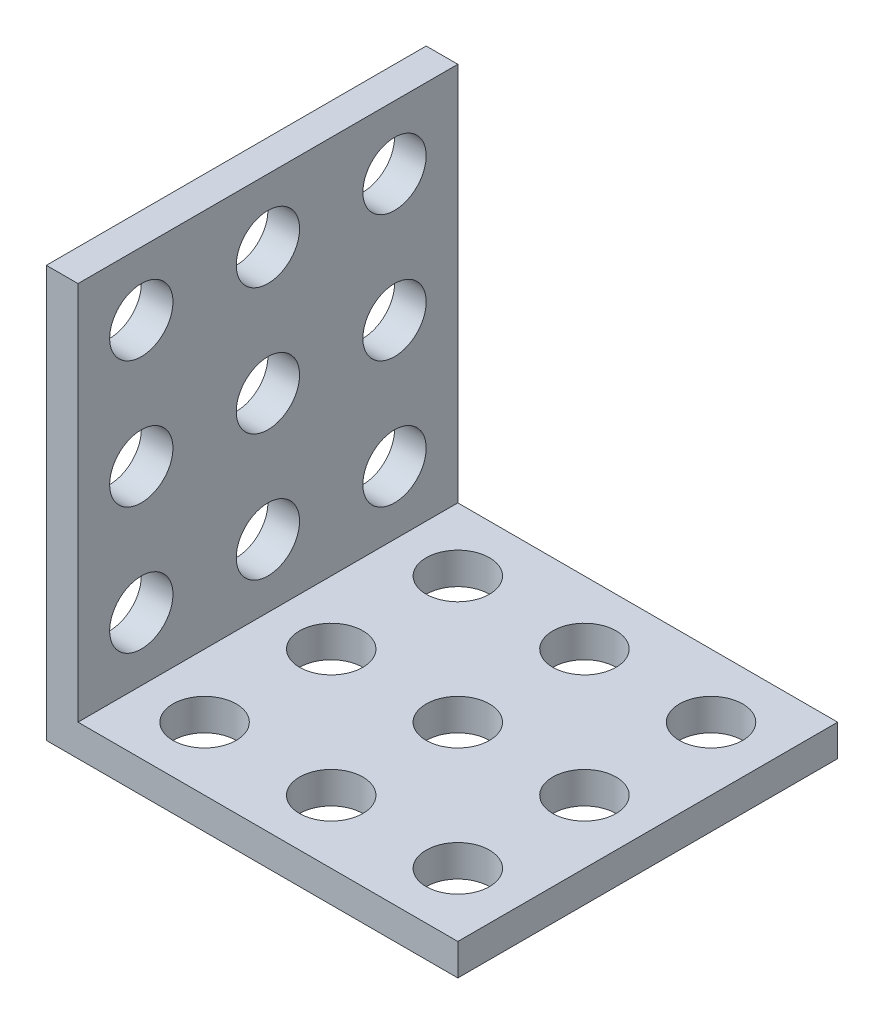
ISO-10303-21;
HEADER;
FILE_DESCRIPTION(('STEP AP214'),'2;1');
FILE_NAME('part.step','',(''),(''),'','','');
FILE_SCHEMA(('AUTOMOTIVE_DESIGN { 1 0 10303 214 1 1 1 1 }'));
ENDSEC;
DATA;
#1=APPLICATION_CONTEXT('core data for automotive mechanical design processes');
#2=APPLICATION_PROTOCOL_DEFINITION('international standard','automotive_design',2000,#1);
#3=PRODUCT_CONTEXT('',#1,'mechanical');
#4=PRODUCT('Part','Part','',(#3));
#5=PRODUCT_RELATED_PRODUCT_CATEGORY('part','',(#4));
#6=PRODUCT_DEFINITION_FORMATION('','',#4);
#7=PRODUCT_DEFINITION_CONTEXT('part definition',#1,'design');
#8=PRODUCT_DEFINITION('design','',#6,#7);
#9=PRODUCT_DEFINITION_SHAPE('','',#8);
#10=(LENGTH_UNIT() NAMED_UNIT(*) SI_UNIT(.MILLI.,.METRE.));
#11=(NAMED_UNIT(*) PLANE_ANGLE_UNIT() SI_UNIT($,.RADIAN.));
#12=(NAMED_UNIT(*) SI_UNIT($,.STERADIAN.) SOLID_ANGLE_UNIT());
#13=UNCERTAINTY_MEASURE_WITH_UNIT(LENGTH_MEASURE(1.E-05),#10,'distance_accuracy_value','');
#14=(GEOMETRIC_REPRESENTATION_CONTEXT(3) GLOBAL_UNCERTAINTY_ASSIGNED_CONTEXT((#13)) GLOBAL_UNIT_ASSIGNED_CONTEXT((#10,
#11,#12)) REPRESENTATION_CONTEXT('',''));
#15=CARTESIAN_POINT('',(0.,0.,0.));
#16=DIRECTION('',(0.,0.,1.));
#17=DIRECTION('',(1.,0.,0.));
#18=AXIS2_PLACEMENT_3D('',#15,#16,#17);
#19=CARTESIAN_POINT('',(26.,0.,24.));
#20=DIRECTION('',(0.,1.,0.));
#21=DIRECTION('',(-1.,0.,0.));
#22=AXIS2_PLACEMENT_3D('',#19,#20,#21);
#23=PLANE('',#22);
#24=CARTESIAN_POINT('',(5.99999999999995,0.,4.));
#25=DIRECTION('',(0.,1.,0.));
#26=DIRECTION('',(-1.,0.,0.));
#27=AXIS2_PLACEMENT_3D('',#24,#25,#26);
#28=CIRCLE('',#27,2.);
#29=CARTESIAN_POINT('',(3.99999999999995,0.,4.));
#30=VERTEX_POINT('',#29);
#31=EDGE_CURVE('E221',#30,#30,#28,.T.);
#32=ORIENTED_EDGE('',*,*,#31,.T.);
#33=EDGE_LOOP('',(#32));
#34=FACE_BOUND('',#33,.T.);
#35=CARTESIAN_POINT('',(5.99999999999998,0.,12.));
#36=DIRECTION('',(0.,1.,0.));
#37=DIRECTION('',(-1.,0.,0.));
#38=AXIS2_PLACEMENT_3D('',#35,#36,#37);
#39=CIRCLE('',#38,2.);
#40=CARTESIAN_POINT('',(3.99999999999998,0.,12.));
#41=VERTEX_POINT('',#40);
#42=EDGE_CURVE('E218',#41,#41,#39,.T.);
#43=ORIENTED_EDGE('',*,*,#42,.T.);
#44=EDGE_LOOP('',(#43));
#45=FACE_BOUND('',#44,.T.);
#46=CARTESIAN_POINT('',(21.9999999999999,0.,4.));
#47=DIRECTION('',(0.,1.,0.));
#48=DIRECTION('',(-1.,0.,0.));
#49=AXIS2_PLACEMENT_3D('',#46,#47,#48);
#50=CIRCLE('',#49,2.);
#51=CARTESIAN_POINT('',(19.9999999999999,0.,4.));
#52=VERTEX_POINT('',#51);
#53=EDGE_CURVE('E215',#52,#52,#50,.T.);
#54=ORIENTED_EDGE('',*,*,#53,.T.);
#55=EDGE_LOOP('',(#54));
#56=FACE_BOUND('',#55,.T.);
#57=CARTESIAN_POINT('',(13.9999999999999,0.,4.));
#58=DIRECTION('',(0.,1.,0.));
#59=DIRECTION('',(-1.,0.,0.));
#60=AXIS2_PLACEMENT_3D('',#57,#58,#59);
#61=CIRCLE('',#60,2.);
#62=CARTESIAN_POINT('',(11.9999999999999,0.,4.));
#63=VERTEX_POINT('',#62);
#64=EDGE_CURVE('E212',#63,#63,#61,.T.);
#65=ORIENTED_EDGE('',*,*,#64,.T.);
#66=EDGE_LOOP('',(#65));
#67=FACE_BOUND('',#66,.T.);
#68=CARTESIAN_POINT('',(22.,0.,12.));
#69=DIRECTION('',(0.,1.,0.));
#70=DIRECTION('',(-1.,0.,0.));
#71=AXIS2_PLACEMENT_3D('',#68,#69,#70);
#72=CIRCLE('',#71,2.);
#73=CARTESIAN_POINT('',(20.,0.,12.));
#74=VERTEX_POINT('',#73);
#75=EDGE_CURVE('E209',#74,#74,#72,.T.);
#76=ORIENTED_EDGE('',*,*,#75,.T.);
#77=EDGE_LOOP('',(#76));
#78=FACE_BOUND('',#77,.T.);
#79=CARTESIAN_POINT('',(14.,0.,12.));
#80=DIRECTION('',(0.,1.,0.));
#81=DIRECTION('',(-1.,0.,0.));
#82=AXIS2_PLACEMENT_3D('',#79,#80,#81);
#83=CIRCLE('',#82,2.);
#84=CARTESIAN_POINT('',(12.,0.,12.));
#85=VERTEX_POINT('',#84);
#86=EDGE_CURVE('E206',#85,#85,#83,.T.);
#87=ORIENTED_EDGE('',*,*,#86,.T.);
#88=EDGE_LOOP('',(#87));
#89=FACE_BOUND('',#88,.T.);
#90=CARTESIAN_POINT('',(22.,0.,20.));
#91=DIRECTION('',(0.,1.,0.));
#92=DIRECTION('',(-1.,0.,0.));
#93=AXIS2_PLACEMENT_3D('',#90,#91,#92);
#94=CIRCLE('',#93,2.);
#95=CARTESIAN_POINT('',(20.,0.,20.));
#96=VERTEX_POINT('',#95);
#97=EDGE_CURVE('E203',#96,#96,#94,.T.);
#98=ORIENTED_EDGE('',*,*,#97,.T.);
#99=EDGE_LOOP('',(#98));
#100=FACE_BOUND('',#99,.T.);
#101=CARTESIAN_POINT('',(14.,0.,20.));
#102=DIRECTION('',(0.,1.,0.));
#103=DIRECTION('',(-1.,0.,0.));
#104=AXIS2_PLACEMENT_3D('',#101,#102,#103);
#105=CIRCLE('',#104,2.);
#106=CARTESIAN_POINT('',(12.,0.,20.));
#107=VERTEX_POINT('',#106);
#108=EDGE_CURVE('E192',#107,#107,#105,.T.);
#109=ORIENTED_EDGE('',*,*,#108,.T.);
#110=EDGE_LOOP('',(#109));
#111=FACE_BOUND('',#110,.T.);
#112=CARTESIAN_POINT('',(6.,0.,20.));
#113=DIRECTION('',(0.,1.,0.));
#114=DIRECTION('',(-1.,0.,0.));
#115=AXIS2_PLACEMENT_3D('',#112,#113,#114);
#116=CIRCLE('',#115,2.);
#117=CARTESIAN_POINT('',(4.,0.,20.));
#118=VERTEX_POINT('',#117);
#119=EDGE_CURVE('E126',#118,#118,#116,.T.);
#120=ORIENTED_EDGE('',*,*,#119,.T.);
#121=EDGE_LOOP('',(#120));
#122=FACE_BOUND('',#121,.T.);
#123=DIRECTION('',(1.,0.,0.));
#124=VECTOR('',#123,1.);
#125=CARTESIAN_POINT('',(26.,0.,0.));
#126=LINE('',#125,#124);
#127=CARTESIAN_POINT('',(0.,0.,0.));
#128=VERTEX_POINT('',#127);
#129=CARTESIAN_POINT('',(26.,0.,0.));
#130=VERTEX_POINT('',#129);
#131=EDGE_CURVE('E122',#128,#130,#126,.T.);
#132=ORIENTED_EDGE('',*,*,#131,.T.);
#133=DIRECTION('',(0.,0.,-1.));
#134=VECTOR('',#133,1.);
#135=CARTESIAN_POINT('',(26.,0.,24.));
#136=LINE('',#135,#134);
#137=CARTESIAN_POINT('',(26.,0.,24.));
#138=VERTEX_POINT('',#137);
#139=EDGE_CURVE('E11',#138,#130,#136,.T.);
#140=ORIENTED_EDGE('',*,*,#139,.F.);
#141=DIRECTION('',(1.,0.,0.));
#142=VECTOR('',#141,1.);
#143=CARTESIAN_POINT('',(26.,0.,24.));
#144=LINE('',#143,#142);
#145=CARTESIAN_POINT('',(0.,0.,24.));
#146=VERTEX_POINT('',#145);
#147=EDGE_CURVE('E133',#146,#138,#144,.T.);
#148=ORIENTED_EDGE('',*,*,#147,.F.);
#149=DIRECTION('',(0.,0.,-1.));
#150=VECTOR('',#149,1.);
#151=CARTESIAN_POINT('',(0.,0.,24.));
#152=LINE('',#151,#150);
#153=EDGE_CURVE('E118',#146,#128,#152,.T.);
#154=ORIENTED_EDGE('',*,*,#153,.T.);
#155=EDGE_LOOP('',(#132,#140,#148,#154));
#156=FACE_BOUND('',#155,.T.);
#157=ADVANCED_FACE('F36',(#34,#45,#56,#67,#78,#89,#100,#111,#122,#156),#23,.F.);
#158=CARTESIAN_POINT('',(26.,2.,24.));
#159=DIRECTION('',(-1.,0.,0.));
#160=DIRECTION('',(0.,0.,1.));
#161=AXIS2_PLACEMENT_3D('',#158,#159,#160);
#162=PLANE('',#161);
#163=DIRECTION('',(0.,1.,0.));
#164=VECTOR('',#163,1.);
#165=CARTESIAN_POINT('',(26.,2.,0.));
#166=LINE('',#165,#164);
#167=CARTESIAN_POINT('',(26.,2.,0.));
#168=VERTEX_POINT('',#167);
#169=EDGE_CURVE('E125',#130,#168,#166,.T.);
#170=ORIENTED_EDGE('',*,*,#169,.T.);
#171=DIRECTION('',(0.,0.,-1.));
#172=VECTOR('',#171,1.);
#173=CARTESIAN_POINT('',(26.,2.,24.));
#174=LINE('',#173,#172);
#175=CARTESIAN_POINT('',(26.,2.,24.));
#176=VERTEX_POINT('',#175);
#177=EDGE_CURVE('E45',#176,#168,#174,.T.);
#178=ORIENTED_EDGE('',*,*,#177,.F.);
#179=DIRECTION('',(0.,1.,0.));
#180=VECTOR('',#179,1.);
#181=CARTESIAN_POINT('',(26.,2.,24.));
#182=LINE('',#181,#180);
#183=EDGE_CURVE('E91',#138,#176,#182,.T.);
#184=ORIENTED_EDGE('',*,*,#183,.F.);
#185=ORIENTED_EDGE('',*,*,#139,.T.);
#186=EDGE_LOOP('',(#170,#178,#184,#185));
#187=FACE_BOUND('',#186,.T.);
#188=ADVANCED_FACE('F232',(#187),#162,.F.);
#189=CARTESIAN_POINT('',(2.,2.,24.));
#190=DIRECTION('',(0.,-1.,0.));
#191=DIRECTION('',(1.,0.,0.));
#192=AXIS2_PLACEMENT_3D('',#189,#190,#191);
#193=PLANE('',#192);
#194=CARTESIAN_POINT('',(5.99999999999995,2.,4.));
#195=DIRECTION('',(0.,1.,0.));
#196=DIRECTION('',(-1.,0.,0.));
#197=AXIS2_PLACEMENT_3D('',#194,#195,#196);
#198=CIRCLE('',#197,2.);
#199=CARTESIAN_POINT('',(3.99999999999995,2.,4.));
#200=VERTEX_POINT('',#199);
#201=EDGE_CURVE('E142',#200,#200,#198,.T.);
#202=ORIENTED_EDGE('',*,*,#201,.F.);
#203=EDGE_LOOP('',(#202));
#204=FACE_BOUND('',#203,.T.);
#205=CARTESIAN_POINT('',(5.99999999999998,2.,12.));
#206=DIRECTION('',(0.,1.,0.));
#207=DIRECTION('',(-1.,0.,0.));
#208=AXIS2_PLACEMENT_3D('',#205,#206,#207);
#209=CIRCLE('',#208,2.);
#210=CARTESIAN_POINT('',(3.99999999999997,2.,12.));
#211=VERTEX_POINT('',#210);
#212=EDGE_CURVE('E184',#211,#211,#209,.T.);
#213=ORIENTED_EDGE('',*,*,#212,.F.);
#214=EDGE_LOOP('',(#213));
#215=FACE_BOUND('',#214,.T.);
#216=CARTESIAN_POINT('',(21.9999999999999,2.,4.));
#217=DIRECTION('',(0.,1.,0.));
#218=DIRECTION('',(-1.,0.,0.));
#219=AXIS2_PLACEMENT_3D('',#216,#217,#218);
#220=CIRCLE('',#219,2.);
#221=CARTESIAN_POINT('',(19.9999999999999,2.,4.));
#222=VERTEX_POINT('',#221);
#223=EDGE_CURVE('E181',#222,#222,#220,.T.);
#224=ORIENTED_EDGE('',*,*,#223,.F.);
#225=EDGE_LOOP('',(#224));
#226=FACE_BOUND('',#225,.T.);
#227=CARTESIAN_POINT('',(13.9999999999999,2.,4.));
#228=DIRECTION('',(0.,1.,0.));
#229=DIRECTION('',(-1.,0.,0.));
#230=AXIS2_PLACEMENT_3D('',#227,#228,#229);
#231=CIRCLE('',#230,2.);
#232=CARTESIAN_POINT('',(11.9999999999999,2.,4.));
#233=VERTEX_POINT('',#232);
#234=EDGE_CURVE('E177',#233,#233,#231,.T.);
#235=ORIENTED_EDGE('',*,*,#234,.F.);
#236=EDGE_LOOP('',(#235));
#237=FACE_BOUND('',#236,.T.);
#238=CARTESIAN_POINT('',(22.,2.,12.));
#239=DIRECTION('',(0.,1.,0.));
#240=DIRECTION('',(-1.,0.,0.));
#241=AXIS2_PLACEMENT_3D('',#238,#239,#240);
#242=CIRCLE('',#241,2.);
#243=CARTESIAN_POINT('',(20.,2.,12.));
#244=VERTEX_POINT('',#243);
#245=EDGE_CURVE('E180',#244,#244,#242,.T.);
#246=ORIENTED_EDGE('',*,*,#245,.F.);
#247=EDGE_LOOP('',(#246));
#248=FACE_BOUND('',#247,.T.);
#249=CARTESIAN_POINT('',(14.,2.,12.));
#250=DIRECTION('',(0.,1.,0.));
#251=DIRECTION('',(-1.,0.,0.));
#252=AXIS2_PLACEMENT_3D('',#249,#250,#251);
#253=CIRCLE('',#252,2.);
#254=CARTESIAN_POINT('',(12.,2.,12.));
#255=VERTEX_POINT('',#254);
#256=EDGE_CURVE('E196',#255,#255,#253,.T.);
#257=ORIENTED_EDGE('',*,*,#256,.F.);
#258=EDGE_LOOP('',(#257));
#259=FACE_BOUND('',#258,.T.);
#260=CARTESIAN_POINT('',(22.,2.,20.));
#261=DIRECTION('',(0.,1.,0.));
#262=DIRECTION('',(-1.,0.,0.));
#263=AXIS2_PLACEMENT_3D('',#260,#261,#262);
#264=CIRCLE('',#263,2.);
#265=CARTESIAN_POINT('',(20.,2.,20.));
#266=VERTEX_POINT('',#265);
#267=EDGE_CURVE('E193',#266,#266,#264,.T.);
#268=ORIENTED_EDGE('',*,*,#267,.F.);
#269=EDGE_LOOP('',(#268));
#270=FACE_BOUND('',#269,.T.);
#271=CARTESIAN_POINT('',(14.,2.,20.));
#272=DIRECTION('',(0.,1.,0.));
#273=DIRECTION('',(-1.,0.,0.));
#274=AXIS2_PLACEMENT_3D('',#271,#272,#273);
#275=CIRCLE('',#274,2.);
#276=CARTESIAN_POINT('',(12.,2.,20.));
#277=VERTEX_POINT('',#276);
#278=EDGE_CURVE('E189',#277,#277,#275,.T.);
#279=ORIENTED_EDGE('',*,*,#278,.F.);
#280=EDGE_LOOP('',(#279));
#281=FACE_BOUND('',#280,.T.);
#282=CARTESIAN_POINT('',(6.,2.,20.));
#283=DIRECTION('',(0.,1.,0.));
#284=DIRECTION('',(-1.,0.,0.));
#285=AXIS2_PLACEMENT_3D('',#282,#283,#284);
#286=CIRCLE('',#285,2.);
#287=CARTESIAN_POINT('',(4.,2.,20.));
#288=VERTEX_POINT('',#287);
#289=EDGE_CURVE('E224',#288,#288,#286,.T.);
#290=ORIENTED_EDGE('',*,*,#289,.F.);
#291=EDGE_LOOP('',(#290));
#292=FACE_BOUND('',#291,.T.);
#293=DIRECTION('',(-1.,0.,0.));
#294=VECTOR('',#293,1.);
#295=CARTESIAN_POINT('',(2.,2.,0.));
#296=LINE('',#295,#294);
#297=CARTESIAN_POINT('',(2.,2.,0.));
#298=VERTEX_POINT('',#297);
#299=EDGE_CURVE('E128',#168,#298,#296,.T.);
#300=ORIENTED_EDGE('',*,*,#299,.T.);
#301=DIRECTION('',(0.,0.,-1.));
#302=VECTOR('',#301,1.);
#303=CARTESIAN_POINT('',(2.,2.,24.));
#304=LINE('',#303,#302);
#305=CARTESIAN_POINT('',(2.,2.,24.));
#306=VERTEX_POINT('',#305);
#307=EDGE_CURVE('E113',#306,#298,#304,.T.);
#308=ORIENTED_EDGE('',*,*,#307,.F.);
#309=DIRECTION('',(-1.,0.,0.));
#310=VECTOR('',#309,1.);
#311=CARTESIAN_POINT('',(2.,2.,24.));
#312=LINE('',#311,#310);
#313=EDGE_CURVE('E104',#176,#306,#312,.T.);
#314=ORIENTED_EDGE('',*,*,#313,.F.);
#315=ORIENTED_EDGE('',*,*,#177,.T.);
#316=EDGE_LOOP('',(#300,#308,#314,#315));
#317=FACE_BOUND('',#316,.T.);
#318=ADVANCED_FACE('F235',(#204,#215,#226,#237,#248,#259,#270,#281,#292,#317),#193,.F.);
#319=CARTESIAN_POINT('',(2.,26.,24.));
#320=DIRECTION('',(-1.,0.,0.));
#321=DIRECTION('',(0.,-1.,0.));
#322=AXIS2_PLACEMENT_3D('',#319,#320,#321);
#323=PLANE('',#322);
#324=CARTESIAN_POINT('',(2.,22.,20.));
#325=DIRECTION('',(1.,0.,0.));
#326=DIRECTION('',(0.,1.,0.));
#327=AXIS2_PLACEMENT_3D('',#324,#325,#326);
#328=CIRCLE('',#327,2.);
#329=CARTESIAN_POINT('',(2.,24.,20.));
#330=VERTEX_POINT('',#329);
#331=EDGE_CURVE('E385',#330,#330,#328,.T.);
#332=ORIENTED_EDGE('',*,*,#331,.F.);
#333=EDGE_LOOP('',(#332));
#334=FACE_BOUND('',#333,.T.);
#335=CARTESIAN_POINT('',(2.,14.,20.));
#336=DIRECTION('',(1.,0.,0.));
#337=DIRECTION('',(0.,1.,0.));
#338=AXIS2_PLACEMENT_3D('',#335,#336,#337);
#339=CIRCLE('',#338,2.);
#340=CARTESIAN_POINT('',(2.,16.,20.));
#341=VERTEX_POINT('',#340);
#342=EDGE_CURVE('E380',#341,#341,#339,.T.);
#343=ORIENTED_EDGE('',*,*,#342,.F.);
#344=EDGE_LOOP('',(#343));
#345=FACE_BOUND('',#344,.T.);
#346=CARTESIAN_POINT('',(2.,22.,4.));
#347=DIRECTION('',(1.,0.,0.));
#348=DIRECTION('',(0.,1.,0.));
#349=AXIS2_PLACEMENT_3D('',#346,#347,#348);
#350=CIRCLE('',#349,2.);
#351=CARTESIAN_POINT('',(2.,24.,4.));
#352=VERTEX_POINT('',#351);
#353=EDGE_CURVE('E375',#352,#352,#350,.T.);
#354=ORIENTED_EDGE('',*,*,#353,.F.);
#355=EDGE_LOOP('',(#354));
#356=FACE_BOUND('',#355,.T.);
#357=CARTESIAN_POINT('',(2.,22.,12.));
#358=DIRECTION('',(1.,0.,0.));
#359=DIRECTION('',(0.,1.,0.));
#360=AXIS2_PLACEMENT_3D('',#357,#358,#359);
#361=CIRCLE('',#360,2.);
#362=CARTESIAN_POINT('',(2.,24.,12.));
#363=VERTEX_POINT('',#362);
#364=EDGE_CURVE('E356',#363,#363,#361,.T.);
#365=ORIENTED_EDGE('',*,*,#364,.F.);
#366=EDGE_LOOP('',(#365));
#367=FACE_BOUND('',#366,.T.);
#368=CARTESIAN_POINT('',(2.,14.,4.));
#369=DIRECTION('',(1.,0.,0.));
#370=DIRECTION('',(0.,1.,0.));
#371=AXIS2_PLACEMENT_3D('',#368,#369,#370);
#372=CIRCLE('',#371,2.);
#373=CARTESIAN_POINT('',(2.,16.,4.));
#374=VERTEX_POINT('',#373);
#375=EDGE_CURVE('E175',#374,#374,#372,.T.);
#376=ORIENTED_EDGE('',*,*,#375,.F.);
#377=EDGE_LOOP('',(#376));
#378=FACE_BOUND('',#377,.T.);
#379=CARTESIAN_POINT('',(2.,14.,12.));
#380=DIRECTION('',(1.,0.,0.));
#381=DIRECTION('',(0.,1.,0.));
#382=AXIS2_PLACEMENT_3D('',#379,#380,#381);
#383=CIRCLE('',#382,2.);
#384=CARTESIAN_POINT('',(2.,16.,12.));
#385=VERTEX_POINT('',#384);
#386=EDGE_CURVE('E378',#385,#385,#383,.T.);
#387=ORIENTED_EDGE('',*,*,#386,.F.);
#388=EDGE_LOOP('',(#387));
#389=FACE_BOUND('',#388,.T.);
#390=CARTESIAN_POINT('',(2.,6.,4.));
#391=DIRECTION('',(1.,0.,0.));
#392=DIRECTION('',(0.,1.,0.));
#393=AXIS2_PLACEMENT_3D('',#390,#391,#392);
#394=CIRCLE('',#393,2.);
#395=CARTESIAN_POINT('',(2.,8.,4.));
#396=VERTEX_POINT('',#395);
#397=EDGE_CURVE('E390',#396,#396,#394,.T.);
#398=ORIENTED_EDGE('',*,*,#397,.F.);
#399=EDGE_LOOP('',(#398));
#400=FACE_BOUND('',#399,.T.);
#401=CARTESIAN_POINT('',(2.,6.,12.));
#402=DIRECTION('',(1.,0.,0.));
#403=DIRECTION('',(0.,1.,0.));
#404=AXIS2_PLACEMENT_3D('',#401,#402,#403);
#405=CIRCLE('',#404,2.);
#406=CARTESIAN_POINT('',(2.,8.,12.));
#407=VERTEX_POINT('',#406);
#408=EDGE_CURVE('E148',#407,#407,#405,.T.);
#409=ORIENTED_EDGE('',*,*,#408,.F.);
#410=EDGE_LOOP('',(#409));
#411=FACE_BOUND('',#410,.T.);
#412=CARTESIAN_POINT('',(2.,6.,20.));
#413=DIRECTION('',(1.,0.,0.));
#414=DIRECTION('',(0.,1.,0.));
#415=AXIS2_PLACEMENT_3D('',#412,#413,#414);
#416=CIRCLE('',#415,2.);
#417=CARTESIAN_POINT('',(2.,8.,20.));
#418=VERTEX_POINT('',#417);
#419=EDGE_CURVE('E143',#418,#418,#416,.T.);
#420=ORIENTED_EDGE('',*,*,#419,.F.);
#421=EDGE_LOOP('',(#420));
#422=FACE_BOUND('',#421,.T.);
#423=DIRECTION('',(0.,1.,0.));
#424=VECTOR('',#423,1.);
#425=CARTESIAN_POINT('',(2.,26.,0.));
#426=LINE('',#425,#424);
#427=CARTESIAN_POINT('',(2.,26.,0.));
#428=VERTEX_POINT('',#427);
#429=EDGE_CURVE('E112',#298,#428,#426,.T.);
#430=ORIENTED_EDGE('',*,*,#429,.T.);
#431=DIRECTION('',(0.,0.,-1.));
#432=VECTOR('',#431,1.);
#433=CARTESIAN_POINT('',(2.,26.,24.));
#434=LINE('',#433,#432);
#435=CARTESIAN_POINT('',(2.,26.,24.));
#436=VERTEX_POINT('',#435);
#437=EDGE_CURVE('E109',#436,#428,#434,.T.);
#438=ORIENTED_EDGE('',*,*,#437,.F.);
#439=DIRECTION('',(0.,1.,0.));
#440=VECTOR('',#439,1.);
#441=CARTESIAN_POINT('',(2.,26.,24.));
#442=LINE('',#441,#440);
#443=EDGE_CURVE('E98',#306,#436,#442,.T.);
#444=ORIENTED_EDGE('',*,*,#443,.F.);
#445=ORIENTED_EDGE('',*,*,#307,.T.);
#446=EDGE_LOOP('',(#430,#438,#444,#445));
#447=FACE_BOUND('',#446,.T.);
#448=ADVANCED_FACE('F110',(#334,#345,#356,#367,#378,#389,#400,#411,#422,#447),#323,.F.);
#449=CARTESIAN_POINT('',(0.,26.,24.));
#450=DIRECTION('',(0.,-1.,0.));
#451=DIRECTION('',(0.,0.,-1.));
#452=AXIS2_PLACEMENT_3D('',#449,#450,#451);
#453=PLANE('',#452);
#454=DIRECTION('',(-1.,0.,0.));
#455=VECTOR('',#454,1.);
#456=CARTESIAN_POINT('',(0.,26.,0.));
#457=LINE('',#456,#455);
#458=CARTESIAN_POINT('',(0.,26.,0.));
#459=VERTEX_POINT('',#458);
#460=EDGE_CURVE('E77',#428,#459,#457,.T.);
#461=ORIENTED_EDGE('',*,*,#460,.T.);
#462=DIRECTION('',(0.,0.,-1.));
#463=VECTOR('',#462,1.);
#464=CARTESIAN_POINT('',(0.,26.,24.));
#465=LINE('',#464,#463);
#466=CARTESIAN_POINT('',(0.,26.,24.));
#467=VERTEX_POINT('',#466);
#468=EDGE_CURVE('E114',#467,#459,#465,.T.);
#469=ORIENTED_EDGE('',*,*,#468,.F.);
#470=DIRECTION('',(-1.,0.,0.));
#471=VECTOR('',#470,1.);
#472=CARTESIAN_POINT('',(0.,26.,24.));
#473=LINE('',#472,#471);
#474=EDGE_CURVE('E102',#436,#467,#473,.T.);
#475=ORIENTED_EDGE('',*,*,#474,.F.);
#476=ORIENTED_EDGE('',*,*,#437,.T.);
#477=EDGE_LOOP('',(#461,#469,#475,#476));
#478=FACE_BOUND('',#477,.T.);
#479=ADVANCED_FACE('F116',(#478),#453,.F.);
#480=CARTESIAN_POINT('',(0.,0.,24.));
#481=DIRECTION('',(1.,0.,0.));
#482=DIRECTION('',(0.,0.,-1.));
#483=AXIS2_PLACEMENT_3D('',#480,#481,#482);
#484=PLANE('',#483);
#485=CARTESIAN_POINT('',(0.,22.,20.));
#486=DIRECTION('',(1.,0.,0.));
#487=DIRECTION('',(0.,0.,-1.));
#488=AXIS2_PLACEMENT_3D('',#485,#486,#487);
#489=CIRCLE('',#488,2.);
#490=CARTESIAN_POINT('',(0.,22.,18.));
#491=VERTEX_POINT('',#490);
#492=EDGE_CURVE('E39',#491,#491,#489,.T.);
#493=ORIENTED_EDGE('',*,*,#492,.T.);
#494=EDGE_LOOP('',(#493));
#495=FACE_BOUND('',#494,.T.);
#496=CARTESIAN_POINT('',(0.,14.,20.));
#497=DIRECTION('',(1.,0.,0.));
#498=DIRECTION('',(0.,0.,-1.));
#499=AXIS2_PLACEMENT_3D('',#496,#497,#498);
#500=CIRCLE('',#499,2.);
#501=CARTESIAN_POINT('',(0.,14.,18.));
#502=VERTEX_POINT('',#501);
#503=EDGE_CURVE('E162',#502,#502,#500,.T.);
#504=ORIENTED_EDGE('',*,*,#503,.T.);
#505=EDGE_LOOP('',(#504));
#506=FACE_BOUND('',#505,.T.);
#507=CARTESIAN_POINT('',(0.,22.,4.));
#508=DIRECTION('',(1.,0.,0.));
#509=DIRECTION('',(0.,0.,-1.));
#510=AXIS2_PLACEMENT_3D('',#507,#508,#509);
#511=CIRCLE('',#510,2.);
#512=CARTESIAN_POINT('',(0.,22.,2.));
#513=VERTEX_POINT('',#512);
#514=EDGE_CURVE('E160',#513,#513,#511,.T.);
#515=ORIENTED_EDGE('',*,*,#514,.T.);
#516=EDGE_LOOP('',(#515));
#517=FACE_BOUND('',#516,.T.);
#518=CARTESIAN_POINT('',(0.,22.,12.));
#519=DIRECTION('',(1.,0.,0.));
#520=DIRECTION('',(0.,0.,-1.));
#521=AXIS2_PLACEMENT_3D('',#518,#519,#520);
#522=CIRCLE('',#521,2.);
#523=CARTESIAN_POINT('',(0.,22.,10.));
#524=VERTEX_POINT('',#523);
#525=EDGE_CURVE('E157',#524,#524,#522,.T.);
#526=ORIENTED_EDGE('',*,*,#525,.T.);
#527=EDGE_LOOP('',(#526));
#528=FACE_BOUND('',#527,.T.);
#529=CARTESIAN_POINT('',(0.,14.,4.));
#530=DIRECTION('',(1.,0.,0.));
#531=DIRECTION('',(0.,0.,-1.));
#532=AXIS2_PLACEMENT_3D('',#529,#530,#531);
#533=CIRCLE('',#532,2.);
#534=CARTESIAN_POINT('',(0.,14.,2.));
#535=VERTEX_POINT('',#534);
#536=EDGE_CURVE('E154',#535,#535,#533,.T.);
#537=ORIENTED_EDGE('',*,*,#536,.T.);
#538=EDGE_LOOP('',(#537));
#539=FACE_BOUND('',#538,.T.);
#540=CARTESIAN_POINT('',(0.,14.,12.));
#541=DIRECTION('',(1.,0.,0.));
#542=DIRECTION('',(0.,0.,-1.));
#543=AXIS2_PLACEMENT_3D('',#540,#541,#542);
#544=CIRCLE('',#543,2.);
#545=CARTESIAN_POINT('',(0.,14.,10.));
#546=VERTEX_POINT('',#545);
#547=EDGE_CURVE('E151',#546,#546,#544,.T.);
#548=ORIENTED_EDGE('',*,*,#547,.T.);
#549=EDGE_LOOP('',(#548));
#550=FACE_BOUND('',#549,.T.);
#551=CARTESIAN_POINT('',(0.,6.,4.));
#552=DIRECTION('',(1.,0.,0.));
#553=DIRECTION('',(0.,0.,-1.));
#554=AXIS2_PLACEMENT_3D('',#551,#552,#553);
#555=CIRCLE('',#554,2.);
#556=CARTESIAN_POINT('',(0.,6.,2.));
#557=VERTEX_POINT('',#556);
#558=EDGE_CURVE('E147',#557,#557,#555,.T.);
#559=ORIENTED_EDGE('',*,*,#558,.T.);
#560=EDGE_LOOP('',(#559));
#561=FACE_BOUND('',#560,.T.);
#562=CARTESIAN_POINT('',(0.,6.,12.));
#563=DIRECTION('',(1.,0.,0.));
#564=DIRECTION('',(0.,0.,-1.));
#565=AXIS2_PLACEMENT_3D('',#562,#563,#564);
#566=CIRCLE('',#565,2.);
#567=CARTESIAN_POINT('',(0.,6.,10.));
#568=VERTEX_POINT('',#567);
#569=EDGE_CURVE('E144',#568,#568,#566,.T.);
#570=ORIENTED_EDGE('',*,*,#569,.T.);
#571=EDGE_LOOP('',(#570));
#572=FACE_BOUND('',#571,.T.);
#573=CARTESIAN_POINT('',(0.,6.,20.));
#574=DIRECTION('',(1.,0.,0.));
#575=DIRECTION('',(0.,0.,-1.));
#576=AXIS2_PLACEMENT_3D('',#573,#574,#575);
#577=CIRCLE('',#576,2.);
#578=CARTESIAN_POINT('',(0.,6.,18.));
#579=VERTEX_POINT('',#578);
#580=EDGE_CURVE('E139',#579,#579,#577,.T.);
#581=ORIENTED_EDGE('',*,*,#580,.T.);
#582=EDGE_LOOP('',(#581));
#583=FACE_BOUND('',#582,.T.);
#584=DIRECTION('',(0.,-1.,0.));
#585=VECTOR('',#584,1.);
#586=CARTESIAN_POINT('',(0.,0.,0.));
#587=LINE('',#586,#585);
#588=EDGE_CURVE('E83',#459,#128,#587,.T.);
#589=ORIENTED_EDGE('',*,*,#588,.T.);
#590=ORIENTED_EDGE('',*,*,#153,.F.);
#591=DIRECTION('',(0.,-1.,0.));
#592=VECTOR('',#591,1.);
#593=CARTESIAN_POINT('',(0.,0.,24.));
#594=LINE('',#593,#592);
#595=EDGE_CURVE('E54',#467,#146,#594,.T.);
#596=ORIENTED_EDGE('',*,*,#595,.F.);
#597=ORIENTED_EDGE('',*,*,#468,.T.);
#598=EDGE_LOOP('',(#589,#590,#596,#597));
#599=FACE_BOUND('',#598,.T.);
#600=ADVANCED_FACE('F240',(#495,#506,#517,#528,#539,#550,#561,#572,#583,#599),#484,.F.);
#601=CARTESIAN_POINT('',(0.,0.,24.));
#602=DIRECTION('',(0.,0.,-1.));
#603=DIRECTION('',(-1.,0.,0.));
#604=AXIS2_PLACEMENT_3D('',#601,#602,#603);
#605=PLANE('',#604);
#606=ORIENTED_EDGE('',*,*,#147,.T.);
#607=ORIENTED_EDGE('',*,*,#183,.T.);
#608=ORIENTED_EDGE('',*,*,#313,.T.);
#609=ORIENTED_EDGE('',*,*,#443,.T.);
#610=ORIENTED_EDGE('',*,*,#474,.T.);
#611=ORIENTED_EDGE('',*,*,#595,.T.);
#612=EDGE_LOOP('',(#606,#607,#608,#609,#610,#611));
#613=FACE_BOUND('',#612,.T.);
#614=ADVANCED_FACE('F100',(#613),#605,.F.);
#615=CARTESIAN_POINT('',(0.,0.,0.));
#616=DIRECTION('',(0.,0.,-1.));
#617=DIRECTION('',(-1.,0.,0.));
#618=AXIS2_PLACEMENT_3D('',#615,#616,#617);
#619=PLANE('',#618);
#620=ORIENTED_EDGE('',*,*,#131,.F.);
#621=ORIENTED_EDGE('',*,*,#588,.F.);
#622=ORIENTED_EDGE('',*,*,#460,.F.);
#623=ORIENTED_EDGE('',*,*,#429,.F.);
#624=ORIENTED_EDGE('',*,*,#299,.F.);
#625=ORIENTED_EDGE('',*,*,#169,.F.);
#626=EDGE_LOOP('',(#620,#621,#622,#623,#624,#625));
#627=FACE_BOUND('',#626,.T.);
#628=ADVANCED_FACE('F238',(#627),#619,.T.);
#629=CARTESIAN_POINT('',(6.00000000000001,-22.,20.));
#630=DIRECTION('',(0.,1.,0.));
#631=DIRECTION('',(-1.,0.,0.));
#632=AXIS2_PLACEMENT_3D('',#629,#630,#631);
#633=CYLINDRICAL_SURFACE('',#632,2.);
#634=ORIENTED_EDGE('',*,*,#289,.T.);
#635=EDGE_LOOP('',(#634));
#636=FACE_BOUND('',#635,.T.);
#637=ORIENTED_EDGE('',*,*,#119,.F.);
#638=EDGE_LOOP('',(#637));
#639=FACE_BOUND('',#638,.T.);
#640=ADVANCED_FACE('F277',(#636,#639),#633,.F.);
#641=CARTESIAN_POINT('',(14.,-22.,20.));
#642=DIRECTION('',(0.,1.,0.));
#643=DIRECTION('',(-1.,0.,0.));
#644=AXIS2_PLACEMENT_3D('',#641,#642,#643);
#645=CYLINDRICAL_SURFACE('',#644,2.);
#646=ORIENTED_EDGE('',*,*,#278,.T.);
#647=EDGE_LOOP('',(#646));
#648=FACE_BOUND('',#647,.T.);
#649=ORIENTED_EDGE('',*,*,#108,.F.);
#650=EDGE_LOOP('',(#649));
#651=FACE_BOUND('',#650,.T.);
#652=ADVANCED_FACE('F279',(#648,#651),#645,.F.);
#653=CARTESIAN_POINT('',(22.,-22.,20.));
#654=DIRECTION('',(0.,1.,0.));
#655=DIRECTION('',(-1.,0.,0.));
#656=AXIS2_PLACEMENT_3D('',#653,#654,#655);
#657=CYLINDRICAL_SURFACE('',#656,2.);
#658=ORIENTED_EDGE('',*,*,#267,.T.);
#659=EDGE_LOOP('',(#658));
#660=FACE_BOUND('',#659,.T.);
#661=ORIENTED_EDGE('',*,*,#97,.F.);
#662=EDGE_LOOP('',(#661));
#663=FACE_BOUND('',#662,.T.);
#664=ADVANCED_FACE('F286',(#660,#663),#657,.F.);
#665=CARTESIAN_POINT('',(14.,-22.,12.));
#666=DIRECTION('',(0.,1.,0.));
#667=DIRECTION('',(-1.,0.,0.));
#668=AXIS2_PLACEMENT_3D('',#665,#666,#667);
#669=CYLINDRICAL_SURFACE('',#668,2.);
#670=ORIENTED_EDGE('',*,*,#256,.T.);
#671=EDGE_LOOP('',(#670));
#672=FACE_BOUND('',#671,.T.);
#673=ORIENTED_EDGE('',*,*,#86,.F.);
#674=EDGE_LOOP('',(#673));
#675=FACE_BOUND('',#674,.T.);
#676=ADVANCED_FACE('F294',(#672,#675),#669,.F.);
#677=CARTESIAN_POINT('',(22.,-22.,12.));
#678=DIRECTION('',(0.,1.,0.));
#679=DIRECTION('',(-1.,0.,0.));
#680=AXIS2_PLACEMENT_3D('',#677,#678,#679);
#681=CYLINDRICAL_SURFACE('',#680,2.);
#682=ORIENTED_EDGE('',*,*,#245,.T.);
#683=EDGE_LOOP('',(#682));
#684=FACE_BOUND('',#683,.T.);
#685=ORIENTED_EDGE('',*,*,#75,.F.);
#686=EDGE_LOOP('',(#685));
#687=FACE_BOUND('',#686,.T.);
#688=ADVANCED_FACE('F290',(#684,#687),#681,.F.);
#689=CARTESIAN_POINT('',(13.9999999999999,-22.,4.));
#690=DIRECTION('',(0.,1.,0.));
#691=DIRECTION('',(-1.,0.,0.));
#692=AXIS2_PLACEMENT_3D('',#689,#690,#691);
#693=CYLINDRICAL_SURFACE('',#692,2.);
#694=ORIENTED_EDGE('',*,*,#234,.T.);
#695=EDGE_LOOP('',(#694));
#696=FACE_BOUND('',#695,.T.);
#697=ORIENTED_EDGE('',*,*,#64,.F.);
#698=EDGE_LOOP('',(#697));
#699=FACE_BOUND('',#698,.T.);
#700=ADVANCED_FACE('F293',(#696,#699),#693,.F.);
#701=CARTESIAN_POINT('',(22.,-22.,4.));
#702=DIRECTION('',(0.,1.,0.));
#703=DIRECTION('',(-1.,0.,0.));
#704=AXIS2_PLACEMENT_3D('',#701,#702,#703);
#705=CYLINDRICAL_SURFACE('',#704,2.);
#706=ORIENTED_EDGE('',*,*,#223,.T.);
#707=EDGE_LOOP('',(#706));
#708=FACE_BOUND('',#707,.T.);
#709=ORIENTED_EDGE('',*,*,#53,.F.);
#710=EDGE_LOOP('',(#709));
#711=FACE_BOUND('',#710,.T.);
#712=ADVANCED_FACE('F310',(#708,#711),#705,.F.);
#713=CARTESIAN_POINT('',(5.99999999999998,-22.,12.));
#714=DIRECTION('',(0.,1.,0.));
#715=DIRECTION('',(-1.,0.,0.));
#716=AXIS2_PLACEMENT_3D('',#713,#714,#715);
#717=CYLINDRICAL_SURFACE('',#716,2.);
#718=ORIENTED_EDGE('',*,*,#212,.T.);
#719=EDGE_LOOP('',(#718));
#720=FACE_BOUND('',#719,.T.);
#721=ORIENTED_EDGE('',*,*,#42,.F.);
#722=EDGE_LOOP('',(#721));
#723=FACE_BOUND('',#722,.T.);
#724=ADVANCED_FACE('F306',(#720,#723),#717,.F.);
#725=CARTESIAN_POINT('',(5.99999999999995,-22.,4.));
#726=DIRECTION('',(0.,1.,0.));
#727=DIRECTION('',(-1.,0.,0.));
#728=AXIS2_PLACEMENT_3D('',#725,#726,#727);
#729=CYLINDRICAL_SURFACE('',#728,2.);
#730=ORIENTED_EDGE('',*,*,#201,.T.);
#731=EDGE_LOOP('',(#730));
#732=FACE_BOUND('',#731,.T.);
#733=ORIENTED_EDGE('',*,*,#31,.F.);
#734=EDGE_LOOP('',(#733));
#735=FACE_BOUND('',#734,.T.);
#736=ADVANCED_FACE('F302',(#732,#735),#729,.F.);
#737=CARTESIAN_POINT('',(-22.,6.,20.));
#738=DIRECTION('',(1.,0.,0.));
#739=DIRECTION('',(0.,1.,0.));
#740=AXIS2_PLACEMENT_3D('',#737,#738,#739);
#741=CYLINDRICAL_SURFACE('',#740,2.);
#742=ORIENTED_EDGE('',*,*,#419,.T.);
#743=EDGE_LOOP('',(#742));
#744=FACE_BOUND('',#743,.T.);
#745=ORIENTED_EDGE('',*,*,#580,.F.);
#746=EDGE_LOOP('',(#745));
#747=FACE_BOUND('',#746,.T.);
#748=ADVANCED_FACE('F305',(#744,#747),#741,.F.);
#749=CARTESIAN_POINT('',(-22.,6.,12.));
#750=DIRECTION('',(1.,0.,0.));
#751=DIRECTION('',(0.,1.,0.));
#752=AXIS2_PLACEMENT_3D('',#749,#750,#751);
#753=CYLINDRICAL_SURFACE('',#752,2.);
#754=ORIENTED_EDGE('',*,*,#408,.T.);
#755=EDGE_LOOP('',(#754));
#756=FACE_BOUND('',#755,.T.);
#757=ORIENTED_EDGE('',*,*,#569,.F.);
#758=EDGE_LOOP('',(#757));
#759=FACE_BOUND('',#758,.T.);
#760=ADVANCED_FACE('F320',(#756,#759),#753,.F.);
#761=CARTESIAN_POINT('',(-22.,6.,4.));
#762=DIRECTION('',(1.,0.,0.));
#763=DIRECTION('',(0.,1.,0.));
#764=AXIS2_PLACEMENT_3D('',#761,#762,#763);
#765=CYLINDRICAL_SURFACE('',#764,2.);
#766=ORIENTED_EDGE('',*,*,#397,.T.);
#767=EDGE_LOOP('',(#766));
#768=FACE_BOUND('',#767,.T.);
#769=ORIENTED_EDGE('',*,*,#558,.F.);
#770=EDGE_LOOP('',(#769));
#771=FACE_BOUND('',#770,.T.);
#772=ADVANCED_FACE('F329',(#768,#771),#765,.F.);
#773=CARTESIAN_POINT('',(-22.,14.,12.));
#774=DIRECTION('',(1.,0.,0.));
#775=DIRECTION('',(0.,1.,0.));
#776=AXIS2_PLACEMENT_3D('',#773,#774,#775);
#777=CYLINDRICAL_SURFACE('',#776,2.);
#778=ORIENTED_EDGE('',*,*,#386,.T.);
#779=EDGE_LOOP('',(#778));
#780=FACE_BOUND('',#779,.T.);
#781=ORIENTED_EDGE('',*,*,#547,.F.);
#782=EDGE_LOOP('',(#781));
#783=FACE_BOUND('',#782,.T.);
#784=ADVANCED_FACE('F325',(#780,#783),#777,.F.);
#785=CARTESIAN_POINT('',(-22.,14.,4.));
#786=DIRECTION('',(1.,0.,0.));
#787=DIRECTION('',(0.,1.,0.));
#788=AXIS2_PLACEMENT_3D('',#785,#786,#787);
#789=CYLINDRICAL_SURFACE('',#788,2.);
#790=ORIENTED_EDGE('',*,*,#375,.T.);
#791=EDGE_LOOP('',(#790));
#792=FACE_BOUND('',#791,.T.);
#793=ORIENTED_EDGE('',*,*,#536,.F.);
#794=EDGE_LOOP('',(#793));
#795=FACE_BOUND('',#794,.T.);
#796=ADVANCED_FACE('F321',(#792,#795),#789,.F.);
#797=CARTESIAN_POINT('',(-22.,22.,12.));
#798=DIRECTION('',(1.,0.,0.));
#799=DIRECTION('',(0.,1.,0.));
#800=AXIS2_PLACEMENT_3D('',#797,#798,#799);
#801=CYLINDRICAL_SURFACE('',#800,2.);
#802=ORIENTED_EDGE('',*,*,#364,.T.);
#803=EDGE_LOOP('',(#802));
#804=FACE_BOUND('',#803,.T.);
#805=ORIENTED_EDGE('',*,*,#525,.F.);
#806=EDGE_LOOP('',(#805));
#807=FACE_BOUND('',#806,.T.);
#808=ADVANCED_FACE('F324',(#804,#807),#801,.F.);
#809=CARTESIAN_POINT('',(-22.,22.,4.));
#810=DIRECTION('',(1.,0.,0.));
#811=DIRECTION('',(0.,1.,0.));
#812=AXIS2_PLACEMENT_3D('',#809,#810,#811);
#813=CYLINDRICAL_SURFACE('',#812,2.);
#814=ORIENTED_EDGE('',*,*,#353,.T.);
#815=EDGE_LOOP('',(#814));
#816=FACE_BOUND('',#815,.T.);
#817=ORIENTED_EDGE('',*,*,#514,.F.);
#818=EDGE_LOOP('',(#817));
#819=FACE_BOUND('',#818,.T.);
#820=ADVANCED_FACE('F344',(#816,#819),#813,.F.);
#821=CARTESIAN_POINT('',(-22.,14.,20.));
#822=DIRECTION('',(1.,0.,0.));
#823=DIRECTION('',(0.,1.,0.));
#824=AXIS2_PLACEMENT_3D('',#821,#822,#823);
#825=CYLINDRICAL_SURFACE('',#824,2.);
#826=ORIENTED_EDGE('',*,*,#342,.T.);
#827=EDGE_LOOP('',(#826));
#828=FACE_BOUND('',#827,.T.);
#829=ORIENTED_EDGE('',*,*,#503,.F.);
#830=EDGE_LOOP('',(#829));
#831=FACE_BOUND('',#830,.T.);
#832=ADVANCED_FACE('F340',(#828,#831),#825,.F.);
#833=CARTESIAN_POINT('',(-22.,22.,20.));
#834=DIRECTION('',(1.,0.,0.));
#835=DIRECTION('',(0.,1.,0.));
#836=AXIS2_PLACEMENT_3D('',#833,#834,#835);
#837=CYLINDRICAL_SURFACE('',#836,2.);
#838=ORIENTED_EDGE('',*,*,#331,.T.);
#839=EDGE_LOOP('',(#838));
#840=FACE_BOUND('',#839,.T.);
#841=ORIENTED_EDGE('',*,*,#492,.F.);
#842=EDGE_LOOP('',(#841));
#843=FACE_BOUND('',#842,.T.);
#844=ADVANCED_FACE('F337',(#840,#843),#837,.F.);
#845=CLOSED_SHELL('',(#157,#188,#318,#448,#479,#600,#614,#628,#640,#652,#664,#676,#688,#700,
#712,#724,#736,#748,#760,#772,#784,#796,#808,#820,#832,#844));
#846=MANIFOLD_SOLID_BREP('B2',#845);
#847=ADVANCED_BREP_SHAPE_REPRESENTATION('',(#18,#846),#14);
#848=SHAPE_DEFINITION_REPRESENTATION(#9,#847);
ENDSEC;
END-ISO-10303-21;
